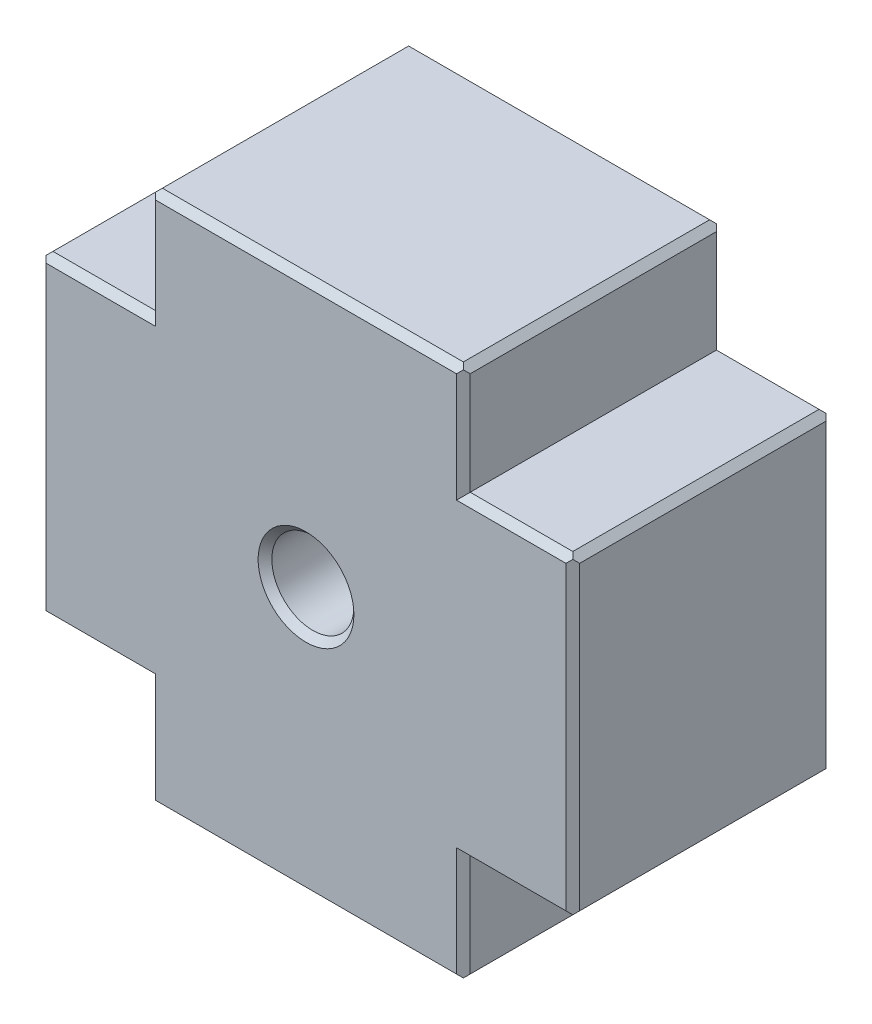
ISO-10303-21;
HEADER;
FILE_DESCRIPTION(('STEP AP214'),'2;1');
FILE_NAME('part.step','',(''),(''),'','','');
FILE_SCHEMA(('AUTOMOTIVE_DESIGN { 1 0 10303 214 1 1 1 1 }'));
ENDSEC;
DATA;
#1=APPLICATION_CONTEXT('core data for automotive mechanical design processes');
#2=APPLICATION_PROTOCOL_DEFINITION('international standard','automotive_design',2000,#1);
#3=PRODUCT_CONTEXT('',#1,'mechanical');
#4=PRODUCT('Part','Part','',(#3));
#5=PRODUCT_RELATED_PRODUCT_CATEGORY('part','',(#4));
#6=PRODUCT_DEFINITION_FORMATION('','',#4);
#7=PRODUCT_DEFINITION_CONTEXT('part definition',#1,'design');
#8=PRODUCT_DEFINITION('design','',#6,#7);
#9=PRODUCT_DEFINITION_SHAPE('','',#8);
#10=(LENGTH_UNIT() NAMED_UNIT(*) SI_UNIT(.MILLI.,.METRE.));
#11=(NAMED_UNIT(*) PLANE_ANGLE_UNIT() SI_UNIT($,.RADIAN.));
#12=(NAMED_UNIT(*) SI_UNIT($,.STERADIAN.) SOLID_ANGLE_UNIT());
#13=UNCERTAINTY_MEASURE_WITH_UNIT(LENGTH_MEASURE(1.E-05),#10,'distance_accuracy_value','');
#14=(GEOMETRIC_REPRESENTATION_CONTEXT(3) GLOBAL_UNCERTAINTY_ASSIGNED_CONTEXT((#13)) GLOBAL_UNIT_ASSIGNED_CONTEXT((#10,
#11,#12)) REPRESENTATION_CONTEXT('',''));
#15=CARTESIAN_POINT('',(0.,0.,0.));
#16=DIRECTION('',(0.,0.,1.));
#17=DIRECTION('',(1.,0.,0.));
#18=AXIS2_PLACEMENT_3D('',#15,#16,#17);
#19=CARTESIAN_POINT('',(0.,-11.5,19.));
#20=DIRECTION('',(0.,-1.,0.));
#21=DIRECTION('',(1.,0.,0.));
#22=AXIS2_PLACEMENT_3D('',#19,#20,#21);
#23=PLANE('',#22);
#24=DIRECTION('',(-1.,0.,0.));
#25=VECTOR('',#24,1.);
#26=CARTESIAN_POINT('',(0.,-11.5,18.5));
#27=LINE('',#26,#25);
#28=CARTESIAN_POINT('',(-11.5,-11.5,18.5));
#29=VERTEX_POINT('',#28);
#30=CARTESIAN_POINT('',(-19.,-11.5,18.5));
#31=VERTEX_POINT('',#30);
#32=EDGE_CURVE('E314',#29,#31,#27,.T.);
#33=ORIENTED_EDGE('',*,*,#32,.T.);
#34=DIRECTION('',(0.,0.,-1.));
#35=VECTOR('',#34,1.);
#36=CARTESIAN_POINT('',(-19.,-11.5,19.));
#37=LINE('',#36,#35);
#38=CARTESIAN_POINT('',(-19.,-11.5,0.5));
#39=VERTEX_POINT('',#38);
#40=EDGE_CURVE('E446',#31,#39,#37,.T.);
#41=ORIENTED_EDGE('',*,*,#40,.T.);
#42=DIRECTION('',(1.,0.,0.));
#43=VECTOR('',#42,1.);
#44=CARTESIAN_POINT('',(-11.5,-11.5,0.500000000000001));
#45=LINE('',#44,#43);
#46=CARTESIAN_POINT('',(-11.5,-11.5,0.5));
#47=VERTEX_POINT('',#46);
#48=EDGE_CURVE('E317',#39,#47,#45,.T.);
#49=ORIENTED_EDGE('',*,*,#48,.T.);
#50=DIRECTION('',(0.,0.,-1.));
#51=VECTOR('',#50,1.);
#52=CARTESIAN_POINT('',(-11.5,-11.5,19.));
#53=LINE('',#52,#51);
#54=EDGE_CURVE('E301',#29,#47,#53,.T.);
#55=ORIENTED_EDGE('',*,*,#54,.F.);
#56=EDGE_LOOP('',(#33,#41,#49,#55));
#57=FACE_BOUND('',#56,.T.);
#58=ADVANCED_FACE('F37',(#57),#23,.T.);
#59=CARTESIAN_POINT('',(-11.5,0.,19.));
#60=DIRECTION('',(1.,0.,0.));
#61=DIRECTION('',(0.,1.,0.));
#62=AXIS2_PLACEMENT_3D('',#59,#60,#61);
#63=PLANE('',#62);
#64=DIRECTION('',(0.,-1.,0.));
#65=VECTOR('',#64,1.);
#66=CARTESIAN_POINT('',(-11.5,0.,0.5));
#67=LINE('',#66,#65);
#68=CARTESIAN_POINT('',(-11.5,-19.,0.5));
#69=VERTEX_POINT('',#68);
#70=EDGE_CURVE('E308',#47,#69,#67,.T.);
#71=ORIENTED_EDGE('',*,*,#70,.T.);
#72=DIRECTION('',(0.,0.,1.));
#73=VECTOR('',#72,1.);
#74=CARTESIAN_POINT('',(-11.5,-19.,18.5));
#75=LINE('',#74,#73);
#76=CARTESIAN_POINT('',(-11.5,-19.,18.5));
#77=VERTEX_POINT('',#76);
#78=EDGE_CURVE('E304',#69,#77,#75,.T.);
#79=ORIENTED_EDGE('',*,*,#78,.T.);
#80=DIRECTION('',(0.,1.,0.));
#81=VECTOR('',#80,1.);
#82=CARTESIAN_POINT('',(-11.5,-11.5,18.5));
#83=LINE('',#82,#81);
#84=EDGE_CURVE('E297',#77,#29,#83,.T.);
#85=ORIENTED_EDGE('',*,*,#84,.T.);
#86=ORIENTED_EDGE('',*,*,#54,.T.);
#87=EDGE_LOOP('',(#71,#79,#85,#86));
#88=FACE_BOUND('',#87,.T.);
#89=ADVANCED_FACE('F300',(#88),#63,.F.);
#90=CARTESIAN_POINT('',(0.,-19.5,19.));
#91=DIRECTION('',(0.,-1.,0.));
#92=DIRECTION('',(1.,0.,0.));
#93=AXIS2_PLACEMENT_3D('',#90,#91,#92);
#94=PLANE('',#93);
#95=DIRECTION('',(-1.,0.,0.));
#96=VECTOR('',#95,1.);
#97=CARTESIAN_POINT('',(0.,-19.5,18.5));
#98=LINE('',#97,#96);
#99=CARTESIAN_POINT('',(11.,-19.5,18.5));
#100=VERTEX_POINT('',#99);
#101=CARTESIAN_POINT('',(-11.,-19.5,18.5));
#102=VERTEX_POINT('',#101);
#103=EDGE_CURVE('E615',#100,#102,#98,.T.);
#104=ORIENTED_EDGE('',*,*,#103,.T.);
#105=DIRECTION('',(0.,0.,-1.));
#106=VECTOR('',#105,1.);
#107=CARTESIAN_POINT('',(-11.,-19.5,0.5));
#108=LINE('',#107,#106);
#109=CARTESIAN_POINT('',(-11.,-19.5,0.499999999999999));
#110=VERTEX_POINT('',#109);
#111=EDGE_CURVE('E453',#102,#110,#108,.T.);
#112=ORIENTED_EDGE('',*,*,#111,.T.);
#113=DIRECTION('',(1.,0.,0.));
#114=VECTOR('',#113,1.);
#115=CARTESIAN_POINT('',(11.5,-19.5,0.5));
#116=LINE('',#115,#114);
#117=CARTESIAN_POINT('',(11.,-19.5,0.5));
#118=VERTEX_POINT('',#117);
#119=EDGE_CURVE('E612',#110,#118,#116,.T.);
#120=ORIENTED_EDGE('',*,*,#119,.T.);
#121=DIRECTION('',(0.,0.,1.));
#122=VECTOR('',#121,1.);
#123=CARTESIAN_POINT('',(11.,-19.5,19.));
#124=LINE('',#123,#122);
#125=EDGE_CURVE('E451',#118,#100,#124,.T.);
#126=ORIENTED_EDGE('',*,*,#125,.T.);
#127=EDGE_LOOP('',(#104,#112,#120,#126));
#128=FACE_BOUND('',#127,.T.);
#129=ADVANCED_FACE('F775',(#128),#94,.T.);
#130=CARTESIAN_POINT('',(11.5,0.,19.));
#131=DIRECTION('',(1.,0.,0.));
#132=DIRECTION('',(0.,1.,0.));
#133=AXIS2_PLACEMENT_3D('',#130,#131,#132);
#134=PLANE('',#133);
#135=DIRECTION('',(0.,-1.,0.));
#136=VECTOR('',#135,1.);
#137=CARTESIAN_POINT('',(11.5,0.,18.5));
#138=LINE('',#137,#136);
#139=CARTESIAN_POINT('',(11.5,-11.5,18.5));
#140=VERTEX_POINT('',#139);
#141=CARTESIAN_POINT('',(11.5,-19.,18.5));
#142=VERTEX_POINT('',#141);
#143=EDGE_CURVE('E609',#140,#142,#138,.T.);
#144=ORIENTED_EDGE('',*,*,#143,.T.);
#145=DIRECTION('',(0.,0.,-1.));
#146=VECTOR('',#145,1.);
#147=CARTESIAN_POINT('',(11.5,-19.,19.));
#148=LINE('',#147,#146);
#149=CARTESIAN_POINT('',(11.5,-19.,0.5));
#150=VERTEX_POINT('',#149);
#151=EDGE_CURVE('E469',#142,#150,#148,.T.);
#152=ORIENTED_EDGE('',*,*,#151,.T.);
#153=DIRECTION('',(0.,1.,0.));
#154=VECTOR('',#153,1.);
#155=CARTESIAN_POINT('',(11.5,-11.5,0.5));
#156=LINE('',#155,#154);
#157=CARTESIAN_POINT('',(11.5,-11.5,0.5));
#158=VERTEX_POINT('',#157);
#159=EDGE_CURVE('E607',#150,#158,#156,.T.);
#160=ORIENTED_EDGE('',*,*,#159,.T.);
#161=DIRECTION('',(0.,0.,-1.));
#162=VECTOR('',#161,1.);
#163=CARTESIAN_POINT('',(11.5,-11.5,19.));
#164=LINE('',#163,#162);
#165=EDGE_CURVE('E318',#140,#158,#164,.T.);
#166=ORIENTED_EDGE('',*,*,#165,.F.);
#167=EDGE_LOOP('',(#144,#152,#160,#166));
#168=FACE_BOUND('',#167,.T.);
#169=ADVANCED_FACE('F695',(#168),#134,.T.);
#170=CARTESIAN_POINT('',(0.,-11.5,19.));
#171=DIRECTION('',(0.,1.,0.));
#172=DIRECTION('',(-1.,0.,0.));
#173=AXIS2_PLACEMENT_3D('',#170,#171,#172);
#174=PLANE('',#173);
#175=DIRECTION('',(1.,0.,0.));
#176=VECTOR('',#175,1.);
#177=CARTESIAN_POINT('',(0.,-11.5,0.5));
#178=LINE('',#177,#176);
#179=CARTESIAN_POINT('',(19.,-11.5,0.5));
#180=VERTEX_POINT('',#179);
#181=EDGE_CURVE('E602',#158,#180,#178,.T.);
#182=ORIENTED_EDGE('',*,*,#181,.T.);
#183=DIRECTION('',(0.,0.,1.));
#184=VECTOR('',#183,1.);
#185=CARTESIAN_POINT('',(19.,-11.5,19.));
#186=LINE('',#185,#184);
#187=CARTESIAN_POINT('',(19.,-11.5,18.5));
#188=VERTEX_POINT('',#187);
#189=EDGE_CURVE('E487',#180,#188,#186,.T.);
#190=ORIENTED_EDGE('',*,*,#189,.T.);
#191=DIRECTION('',(-1.,0.,0.));
#192=VECTOR('',#191,1.);
#193=CARTESIAN_POINT('',(11.5,-11.5,18.5));
#194=LINE('',#193,#192);
#195=EDGE_CURVE('E605',#188,#140,#194,.T.);
#196=ORIENTED_EDGE('',*,*,#195,.T.);
#197=ORIENTED_EDGE('',*,*,#165,.T.);
#198=EDGE_LOOP('',(#182,#190,#196,#197));
#199=FACE_BOUND('',#198,.T.);
#200=ADVANCED_FACE('F709',(#199),#174,.F.);
#201=CARTESIAN_POINT('',(19.5,0.,19.));
#202=DIRECTION('',(-1.,0.,0.));
#203=DIRECTION('',(0.,0.,1.));
#204=AXIS2_PLACEMENT_3D('',#201,#202,#203);
#205=PLANE('',#204);
#206=DIRECTION('',(0.,-1.,0.));
#207=VECTOR('',#206,1.);
#208=CARTESIAN_POINT('',(19.5,-11.5,18.5));
#209=LINE('',#208,#207);
#210=CARTESIAN_POINT('',(19.5,11.,18.5));
#211=VERTEX_POINT('',#210);
#212=CARTESIAN_POINT('',(19.5,-11.,18.5));
#213=VERTEX_POINT('',#212);
#214=EDGE_CURVE('E599',#211,#213,#209,.T.);
#215=ORIENTED_EDGE('',*,*,#214,.T.);
#216=DIRECTION('',(0.,0.,-1.));
#217=VECTOR('',#216,1.);
#218=CARTESIAN_POINT('',(19.5,-11.,19.));
#219=LINE('',#218,#217);
#220=CARTESIAN_POINT('',(19.5,-11.,0.5));
#221=VERTEX_POINT('',#220);
#222=EDGE_CURVE('E478',#213,#221,#219,.T.);
#223=ORIENTED_EDGE('',*,*,#222,.T.);
#224=DIRECTION('',(0.,1.,0.));
#225=VECTOR('',#224,1.);
#226=CARTESIAN_POINT('',(19.5,0.,0.5));
#227=LINE('',#226,#225);
#228=CARTESIAN_POINT('',(19.5,11.,0.5));
#229=VERTEX_POINT('',#228);
#230=EDGE_CURVE('E596',#221,#229,#227,.T.);
#231=ORIENTED_EDGE('',*,*,#230,.T.);
#232=DIRECTION('',(0.,0.,1.));
#233=VECTOR('',#232,1.);
#234=CARTESIAN_POINT('',(19.5,11.,18.5));
#235=LINE('',#234,#233);
#236=EDGE_CURVE('E476',#229,#211,#235,.T.);
#237=ORIENTED_EDGE('',*,*,#236,.T.);
#238=EDGE_LOOP('',(#215,#223,#231,#237));
#239=FACE_BOUND('',#238,.T.);
#240=ADVANCED_FACE('F789',(#239),#205,.F.);
#241=CARTESIAN_POINT('',(0.,11.5,19.));
#242=DIRECTION('',(0.,1.,0.));
#243=DIRECTION('',(-1.,0.,0.));
#244=AXIS2_PLACEMENT_3D('',#241,#242,#243);
#245=PLANE('',#244);
#246=DIRECTION('',(1.,0.,0.));
#247=VECTOR('',#246,1.);
#248=CARTESIAN_POINT('',(0.,11.5,18.5));
#249=LINE('',#248,#247);
#250=CARTESIAN_POINT('',(11.5,11.5,18.5));
#251=VERTEX_POINT('',#250);
#252=CARTESIAN_POINT('',(19.,11.5,18.5));
#253=VERTEX_POINT('',#252);
#254=EDGE_CURVE('E593',#251,#253,#249,.T.);
#255=ORIENTED_EDGE('',*,*,#254,.T.);
#256=DIRECTION('',(0.,0.,-1.));
#257=VECTOR('',#256,1.);
#258=CARTESIAN_POINT('',(19.,11.5,0.5));
#259=LINE('',#258,#257);
#260=CARTESIAN_POINT('',(19.,11.5,0.500000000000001));
#261=VERTEX_POINT('',#260);
#262=EDGE_CURVE('E495',#253,#261,#259,.T.);
#263=ORIENTED_EDGE('',*,*,#262,.T.);
#264=DIRECTION('',(-1.,0.,0.));
#265=VECTOR('',#264,1.);
#266=CARTESIAN_POINT('',(11.5,11.5,0.500000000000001));
#267=LINE('',#266,#265);
#268=CARTESIAN_POINT('',(11.5,11.5,0.5));
#269=VERTEX_POINT('',#268);
#270=EDGE_CURVE('E591',#261,#269,#267,.T.);
#271=ORIENTED_EDGE('',*,*,#270,.T.);
#272=DIRECTION('',(0.,0.,-1.));
#273=VECTOR('',#272,1.);
#274=CARTESIAN_POINT('',(11.5,11.5,19.));
#275=LINE('',#274,#273);
#276=EDGE_CURVE('E650',#251,#269,#275,.T.);
#277=ORIENTED_EDGE('',*,*,#276,.F.);
#278=EDGE_LOOP('',(#255,#263,#271,#277));
#279=FACE_BOUND('',#278,.T.);
#280=ADVANCED_FACE('F799',(#279),#245,.T.);
#281=CARTESIAN_POINT('',(11.5,0.,19.));
#282=DIRECTION('',(-1.,0.,0.));
#283=DIRECTION('',(0.,-1.,0.));
#284=AXIS2_PLACEMENT_3D('',#281,#282,#283);
#285=PLANE('',#284);
#286=DIRECTION('',(0.,1.,0.));
#287=VECTOR('',#286,1.);
#288=CARTESIAN_POINT('',(11.5,0.,0.5));
#289=LINE('',#288,#287);
#290=CARTESIAN_POINT('',(11.5,19.,0.5));
#291=VERTEX_POINT('',#290);
#292=EDGE_CURVE('E586',#269,#291,#289,.T.);
#293=ORIENTED_EDGE('',*,*,#292,.T.);
#294=DIRECTION('',(0.,0.,1.));
#295=VECTOR('',#294,1.);
#296=CARTESIAN_POINT('',(11.5,19.,19.));
#297=LINE('',#296,#295);
#298=CARTESIAN_POINT('',(11.5,19.,18.5));
#299=VERTEX_POINT('',#298);
#300=EDGE_CURVE('E513',#291,#299,#297,.T.);
#301=ORIENTED_EDGE('',*,*,#300,.T.);
#302=DIRECTION('',(0.,-1.,0.));
#303=VECTOR('',#302,1.);
#304=CARTESIAN_POINT('',(11.5,11.5,18.5));
#305=LINE('',#304,#303);
#306=EDGE_CURVE('E589',#299,#251,#305,.T.);
#307=ORIENTED_EDGE('',*,*,#306,.T.);
#308=ORIENTED_EDGE('',*,*,#276,.T.);
#309=EDGE_LOOP('',(#293,#301,#307,#308));
#310=FACE_BOUND('',#309,.T.);
#311=ADVANCED_FACE('F803',(#310),#285,.F.);
#312=CARTESIAN_POINT('',(0.,19.5,19.));
#313=DIRECTION('',(0.,-1.,0.));
#314=DIRECTION('',(1.,0.,0.));
#315=AXIS2_PLACEMENT_3D('',#312,#313,#314);
#316=PLANE('',#315);
#317=DIRECTION('',(1.,0.,0.));
#318=VECTOR('',#317,1.);
#319=CARTESIAN_POINT('',(11.5,19.5,18.5));
#320=LINE('',#319,#318);
#321=CARTESIAN_POINT('',(-11.,19.5,18.5));
#322=VERTEX_POINT('',#321);
#323=CARTESIAN_POINT('',(11.,19.5,18.5));
#324=VERTEX_POINT('',#323);
#325=EDGE_CURVE('E583',#322,#324,#320,.T.);
#326=ORIENTED_EDGE('',*,*,#325,.T.);
#327=DIRECTION('',(0.,0.,-1.));
#328=VECTOR('',#327,1.);
#329=CARTESIAN_POINT('',(11.,19.5,19.));
#330=LINE('',#329,#328);
#331=CARTESIAN_POINT('',(11.,19.5,0.5));
#332=VERTEX_POINT('',#331);
#333=EDGE_CURVE('E504',#324,#332,#330,.T.);
#334=ORIENTED_EDGE('',*,*,#333,.T.);
#335=DIRECTION('',(-1.,0.,0.));
#336=VECTOR('',#335,1.);
#337=CARTESIAN_POINT('',(0.,19.5,0.5));
#338=LINE('',#337,#336);
#339=CARTESIAN_POINT('',(-11.,19.5,0.5));
#340=VERTEX_POINT('',#339);
#341=EDGE_CURVE('E580',#332,#340,#338,.T.);
#342=ORIENTED_EDGE('',*,*,#341,.T.);
#343=DIRECTION('',(0.,0.,1.));
#344=VECTOR('',#343,1.);
#345=CARTESIAN_POINT('',(-11.,19.5,18.5));
#346=LINE('',#345,#344);
#347=EDGE_CURVE('E502',#340,#322,#346,.T.);
#348=ORIENTED_EDGE('',*,*,#347,.T.);
#349=EDGE_LOOP('',(#326,#334,#342,#348));
#350=FACE_BOUND('',#349,.T.);
#351=ADVANCED_FACE('F749',(#350),#316,.F.);
#352=CARTESIAN_POINT('',(-11.5,0.,19.));
#353=DIRECTION('',(-1.,0.,0.));
#354=DIRECTION('',(0.,-1.,0.));
#355=AXIS2_PLACEMENT_3D('',#352,#353,#354);
#356=PLANE('',#355);
#357=DIRECTION('',(0.,1.,0.));
#358=VECTOR('',#357,1.);
#359=CARTESIAN_POINT('',(-11.5,0.,18.5));
#360=LINE('',#359,#358);
#361=CARTESIAN_POINT('',(-11.5,11.5,18.5));
#362=VERTEX_POINT('',#361);
#363=CARTESIAN_POINT('',(-11.5,19.,18.5));
#364=VERTEX_POINT('',#363);
#365=EDGE_CURVE('E578',#362,#364,#360,.T.);
#366=ORIENTED_EDGE('',*,*,#365,.T.);
#367=DIRECTION('',(0.,0.,-1.));
#368=VECTOR('',#367,1.);
#369=CARTESIAN_POINT('',(-11.5,19.,0.5));
#370=LINE('',#369,#368);
#371=CARTESIAN_POINT('',(-11.5,19.,0.5));
#372=VERTEX_POINT('',#371);
#373=EDGE_CURVE('E521',#364,#372,#370,.T.);
#374=ORIENTED_EDGE('',*,*,#373,.T.);
#375=DIRECTION('',(0.,-1.,0.));
#376=VECTOR('',#375,1.);
#377=CARTESIAN_POINT('',(-11.5,11.5,0.5));
#378=LINE('',#377,#376);
#379=CARTESIAN_POINT('',(-11.5,11.5,0.5));
#380=VERTEX_POINT('',#379);
#381=EDGE_CURVE('E576',#372,#380,#378,.T.);
#382=ORIENTED_EDGE('',*,*,#381,.T.);
#383=DIRECTION('',(0.,0.,-1.));
#384=VECTOR('',#383,1.);
#385=CARTESIAN_POINT('',(-11.5,11.5,19.));
#386=LINE('',#385,#384);
#387=EDGE_CURVE('E402',#362,#380,#386,.T.);
#388=ORIENTED_EDGE('',*,*,#387,.F.);
#389=EDGE_LOOP('',(#366,#374,#382,#388));
#390=FACE_BOUND('',#389,.T.);
#391=ADVANCED_FACE('F745',(#390),#356,.T.);
#392=CARTESIAN_POINT('',(0.,11.5,19.));
#393=DIRECTION('',(0.,-1.,0.));
#394=DIRECTION('',(1.,0.,0.));
#395=AXIS2_PLACEMENT_3D('',#392,#393,#394);
#396=PLANE('',#395);
#397=DIRECTION('',(-1.,0.,0.));
#398=VECTOR('',#397,1.);
#399=CARTESIAN_POINT('',(0.,11.5,0.5));
#400=LINE('',#399,#398);
#401=CARTESIAN_POINT('',(-19.,11.5,0.5));
#402=VERTEX_POINT('',#401);
#403=EDGE_CURVE('E571',#380,#402,#400,.T.);
#404=ORIENTED_EDGE('',*,*,#403,.T.);
#405=DIRECTION('',(0.,0.,1.));
#406=VECTOR('',#405,1.);
#407=CARTESIAN_POINT('',(-19.,11.5,18.5));
#408=LINE('',#407,#406);
#409=CARTESIAN_POINT('',(-19.,11.5,18.5));
#410=VERTEX_POINT('',#409);
#411=EDGE_CURVE('E438',#402,#410,#408,.T.);
#412=ORIENTED_EDGE('',*,*,#411,.T.);
#413=DIRECTION('',(1.,0.,0.));
#414=VECTOR('',#413,1.);
#415=CARTESIAN_POINT('',(-11.5,11.5,18.5));
#416=LINE('',#415,#414);
#417=EDGE_CURVE('E559',#410,#362,#416,.T.);
#418=ORIENTED_EDGE('',*,*,#417,.T.);
#419=ORIENTED_EDGE('',*,*,#387,.T.);
#420=EDGE_LOOP('',(#404,#412,#418,#419));
#421=FACE_BOUND('',#420,.T.);
#422=ADVANCED_FACE('F657',(#421),#396,.F.);
#423=CARTESIAN_POINT('',(-19.5,0.,19.));
#424=DIRECTION('',(-1.,0.,0.));
#425=DIRECTION('',(0.,0.,1.));
#426=AXIS2_PLACEMENT_3D('',#423,#424,#425);
#427=PLANE('',#426);
#428=DIRECTION('',(0.,1.,0.));
#429=VECTOR('',#428,1.);
#430=CARTESIAN_POINT('',(-19.5,0.,18.5));
#431=LINE('',#430,#429);
#432=CARTESIAN_POINT('',(-19.5,-11.,18.5));
#433=VERTEX_POINT('',#432);
#434=CARTESIAN_POINT('',(-19.5,11.,18.5));
#435=VERTEX_POINT('',#434);
#436=EDGE_CURVE('E340',#433,#435,#431,.T.);
#437=ORIENTED_EDGE('',*,*,#436,.T.);
#438=DIRECTION('',(0.,0.,-1.));
#439=VECTOR('',#438,1.);
#440=CARTESIAN_POINT('',(-19.5,11.,0.5));
#441=LINE('',#440,#439);
#442=CARTESIAN_POINT('',(-19.5,11.,0.5));
#443=VERTEX_POINT('',#442);
#444=EDGE_CURVE('E429',#435,#443,#441,.T.);
#445=ORIENTED_EDGE('',*,*,#444,.T.);
#446=DIRECTION('',(0.,-1.,0.));
#447=VECTOR('',#446,1.);
#448=CARTESIAN_POINT('',(-19.5,-11.5,0.5));
#449=LINE('',#448,#447);
#450=CARTESIAN_POINT('',(-19.5,-11.,0.5));
#451=VERTEX_POINT('',#450);
#452=EDGE_CURVE('E335',#443,#451,#449,.T.);
#453=ORIENTED_EDGE('',*,*,#452,.T.);
#454=DIRECTION('',(0.,0.,1.));
#455=VECTOR('',#454,1.);
#456=CARTESIAN_POINT('',(-19.5,-11.,19.));
#457=LINE('',#456,#455);
#458=EDGE_CURVE('E369',#451,#433,#457,.T.);
#459=ORIENTED_EDGE('',*,*,#458,.T.);
#460=EDGE_LOOP('',(#437,#445,#453,#459));
#461=FACE_BOUND('',#460,.T.);
#462=ADVANCED_FACE('F545',(#461),#427,.T.);
#463=CARTESIAN_POINT('',(0.,0.,19.));
#464=DIRECTION('',(0.,0.,1.));
#465=DIRECTION('',(1.,0.,0.));
#466=AXIS2_PLACEMENT_3D('',#463,#464,#465);
#467=PLANE('',#466);
#468=CARTESIAN_POINT('',(0.,0.,19.));
#469=DIRECTION('',(0.,0.,1.));
#470=DIRECTION('',(1.,0.,0.));
#471=AXIS2_PLACEMENT_3D('',#468,#469,#470);
#472=CIRCLE('',#471,3.5);
#473=CARTESIAN_POINT('',(3.5,0.,19.));
#474=VERTEX_POINT('',#473);
#475=EDGE_CURVE('E525',#474,#474,#472,.F.);
#476=ORIENTED_EDGE('',*,*,#475,.T.);
#477=EDGE_LOOP('',(#476));
#478=FACE_BOUND('',#477,.T.);
#479=DIRECTION('',(-1.,0.,0.));
#480=VECTOR('',#479,1.);
#481=CARTESIAN_POINT('',(-19.5,11.,19.));
#482=LINE('',#481,#480);
#483=CARTESIAN_POINT('',(-11.,11.,19.));
#484=VERTEX_POINT('',#483);
#485=CARTESIAN_POINT('',(-19.,11.,19.));
#486=VERTEX_POINT('',#485);
#487=EDGE_CURVE('E364',#484,#486,#482,.T.);
#488=ORIENTED_EDGE('',*,*,#487,.T.);
#489=DIRECTION('',(0.,-1.,0.));
#490=VECTOR('',#489,1.);
#491=CARTESIAN_POINT('',(-19.,0.,19.));
#492=LINE('',#491,#490);
#493=CARTESIAN_POINT('',(-19.,-11.,19.));
#494=VERTEX_POINT('',#493);
#495=EDGE_CURVE('E366',#486,#494,#492,.T.);
#496=ORIENTED_EDGE('',*,*,#495,.T.);
#497=DIRECTION('',(1.,0.,0.));
#498=VECTOR('',#497,1.);
#499=CARTESIAN_POINT('',(0.,-11.,19.));
#500=LINE('',#499,#498);
#501=CARTESIAN_POINT('',(-11.,-11.,19.));
#502=VERTEX_POINT('',#501);
#503=EDGE_CURVE('E337',#494,#502,#500,.T.);
#504=ORIENTED_EDGE('',*,*,#503,.T.);
#505=DIRECTION('',(0.,-1.,0.));
#506=VECTOR('',#505,1.);
#507=CARTESIAN_POINT('',(-11.,-19.5,19.));
#508=LINE('',#507,#506);
#509=CARTESIAN_POINT('',(-11.,-19.,19.));
#510=VERTEX_POINT('',#509);
#511=EDGE_CURVE('E325',#502,#510,#508,.T.);
#512=ORIENTED_EDGE('',*,*,#511,.T.);
#513=DIRECTION('',(1.,0.,0.));
#514=VECTOR('',#513,1.);
#515=CARTESIAN_POINT('',(0.,-19.,19.));
#516=LINE('',#515,#514);
#517=CARTESIAN_POINT('',(11.,-19.,19.));
#518=VERTEX_POINT('',#517);
#519=EDGE_CURVE('E346',#510,#518,#516,.T.);
#520=ORIENTED_EDGE('',*,*,#519,.T.);
#521=DIRECTION('',(0.,1.,0.));
#522=VECTOR('',#521,1.);
#523=CARTESIAN_POINT('',(11.,0.,19.));
#524=LINE('',#523,#522);
#525=CARTESIAN_POINT('',(11.,-11.,19.));
#526=VERTEX_POINT('',#525);
#527=EDGE_CURVE('E349',#518,#526,#524,.T.);
#528=ORIENTED_EDGE('',*,*,#527,.T.);
#529=DIRECTION('',(1.,0.,0.));
#530=VECTOR('',#529,1.);
#531=CARTESIAN_POINT('',(19.5,-11.,19.));
#532=LINE('',#531,#530);
#533=CARTESIAN_POINT('',(19.,-11.,19.));
#534=VERTEX_POINT('',#533);
#535=EDGE_CURVE('E351',#526,#534,#532,.T.);
#536=ORIENTED_EDGE('',*,*,#535,.T.);
#537=DIRECTION('',(0.,1.,0.));
#538=VECTOR('',#537,1.);
#539=CARTESIAN_POINT('',(19.,11.5,19.));
#540=LINE('',#539,#538);
#541=CARTESIAN_POINT('',(19.,11.,19.));
#542=VERTEX_POINT('',#541);
#543=EDGE_CURVE('E354',#534,#542,#540,.T.);
#544=ORIENTED_EDGE('',*,*,#543,.T.);
#545=DIRECTION('',(-1.,0.,0.));
#546=VECTOR('',#545,1.);
#547=CARTESIAN_POINT('',(0.,11.,19.));
#548=LINE('',#547,#546);
#549=CARTESIAN_POINT('',(11.,11.,19.));
#550=VERTEX_POINT('',#549);
#551=EDGE_CURVE('E356',#542,#550,#548,.T.);
#552=ORIENTED_EDGE('',*,*,#551,.T.);
#553=DIRECTION('',(0.,1.,0.));
#554=VECTOR('',#553,1.);
#555=CARTESIAN_POINT('',(11.,19.5,19.));
#556=LINE('',#555,#554);
#557=CARTESIAN_POINT('',(11.,19.,19.));
#558=VERTEX_POINT('',#557);
#559=EDGE_CURVE('E358',#550,#558,#556,.T.);
#560=ORIENTED_EDGE('',*,*,#559,.T.);
#561=DIRECTION('',(-1.,0.,0.));
#562=VECTOR('',#561,1.);
#563=CARTESIAN_POINT('',(-11.5,19.,19.));
#564=LINE('',#563,#562);
#565=CARTESIAN_POINT('',(-11.,19.,19.));
#566=VERTEX_POINT('',#565);
#567=EDGE_CURVE('E360',#558,#566,#564,.T.);
#568=ORIENTED_EDGE('',*,*,#567,.T.);
#569=DIRECTION('',(0.,-1.,0.));
#570=VECTOR('',#569,1.);
#571=CARTESIAN_POINT('',(-11.,0.,19.));
#572=LINE('',#571,#570);
#573=EDGE_CURVE('E362',#566,#484,#572,.T.);
#574=ORIENTED_EDGE('',*,*,#573,.T.);
#575=EDGE_LOOP('',(#488,#496,#504,#512,#520,#528,#536,#544,#552,#560,#568,#574));
#576=FACE_BOUND('',#575,.T.);
#577=ADVANCED_FACE('F541',(#478,#576),#467,.T.);
#578=CARTESIAN_POINT('',(0.,0.,0.));
#579=DIRECTION('',(0.,0.,1.));
#580=DIRECTION('',(1.,0.,0.));
#581=AXIS2_PLACEMENT_3D('',#578,#579,#580);
#582=PLANE('',#581);
#583=CARTESIAN_POINT('',(0.,0.,0.));
#584=DIRECTION('',(0.,0.,1.));
#585=DIRECTION('',(1.,0.,0.));
#586=AXIS2_PLACEMENT_3D('',#583,#584,#585);
#587=CIRCLE('',#586,3.50000000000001);
#588=CARTESIAN_POINT('',(3.50000000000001,0.,0.));
#589=VERTEX_POINT('',#588);
#590=EDGE_CURVE('E11',#589,#589,#587,.T.);
#591=ORIENTED_EDGE('',*,*,#590,.T.);
#592=EDGE_LOOP('',(#591));
#593=FACE_BOUND('',#592,.T.);
#594=DIRECTION('',(-1.,0.,0.));
#595=VECTOR('',#594,1.);
#596=CARTESIAN_POINT('',(-11.5,-19.,0.));
#597=LINE('',#596,#595);
#598=CARTESIAN_POINT('',(11.,-19.,0.));
#599=VERTEX_POINT('',#598);
#600=CARTESIAN_POINT('',(-11.,-19.,0.));
#601=VERTEX_POINT('',#600);
#602=EDGE_CURVE('E621',#599,#601,#597,.T.);
#603=ORIENTED_EDGE('',*,*,#602,.T.);
#604=DIRECTION('',(0.,1.,0.));
#605=VECTOR('',#604,1.);
#606=CARTESIAN_POINT('',(-11.,0.,0.));
#607=LINE('',#606,#605);
#608=CARTESIAN_POINT('',(-11.,-11.,0.));
#609=VERTEX_POINT('',#608);
#610=EDGE_CURVE('E618',#601,#609,#607,.T.);
#611=ORIENTED_EDGE('',*,*,#610,.T.);
#612=DIRECTION('',(-1.,0.,0.));
#613=VECTOR('',#612,1.);
#614=CARTESIAN_POINT('',(-19.5,-11.,0.));
#615=LINE('',#614,#613);
#616=CARTESIAN_POINT('',(-19.,-11.,0.));
#617=VERTEX_POINT('',#616);
#618=EDGE_CURVE('E644',#609,#617,#615,.T.);
#619=ORIENTED_EDGE('',*,*,#618,.T.);
#620=DIRECTION('',(0.,1.,0.));
#621=VECTOR('',#620,1.);
#622=CARTESIAN_POINT('',(-19.,11.5,0.));
#623=LINE('',#622,#621);
#624=CARTESIAN_POINT('',(-19.,11.,0.));
#625=VERTEX_POINT('',#624);
#626=EDGE_CURVE('E641',#617,#625,#623,.T.);
#627=ORIENTED_EDGE('',*,*,#626,.T.);
#628=DIRECTION('',(1.,0.,0.));
#629=VECTOR('',#628,1.);
#630=CARTESIAN_POINT('',(0.,11.,0.));
#631=LINE('',#630,#629);
#632=CARTESIAN_POINT('',(-11.,11.,0.));
#633=VERTEX_POINT('',#632);
#634=EDGE_CURVE('E639',#625,#633,#631,.T.);
#635=ORIENTED_EDGE('',*,*,#634,.T.);
#636=DIRECTION('',(0.,1.,0.));
#637=VECTOR('',#636,1.);
#638=CARTESIAN_POINT('',(-11.,19.5,0.));
#639=LINE('',#638,#637);
#640=CARTESIAN_POINT('',(-11.,19.,0.));
#641=VERTEX_POINT('',#640);
#642=EDGE_CURVE('E636',#633,#641,#639,.T.);
#643=ORIENTED_EDGE('',*,*,#642,.T.);
#644=DIRECTION('',(1.,0.,0.));
#645=VECTOR('',#644,1.);
#646=CARTESIAN_POINT('',(0.,19.,0.));
#647=LINE('',#646,#645);
#648=CARTESIAN_POINT('',(11.,19.,0.));
#649=VERTEX_POINT('',#648);
#650=EDGE_CURVE('E633',#641,#649,#647,.T.);
#651=ORIENTED_EDGE('',*,*,#650,.T.);
#652=DIRECTION('',(0.,-1.,0.));
#653=VECTOR('',#652,1.);
#654=CARTESIAN_POINT('',(11.,0.,0.));
#655=LINE('',#654,#653);
#656=CARTESIAN_POINT('',(11.,11.,0.));
#657=VERTEX_POINT('',#656);
#658=EDGE_CURVE('E631',#649,#657,#655,.T.);
#659=ORIENTED_EDGE('',*,*,#658,.T.);
#660=DIRECTION('',(1.,0.,0.));
#661=VECTOR('',#660,1.);
#662=CARTESIAN_POINT('',(19.5,11.,0.));
#663=LINE('',#662,#661);
#664=CARTESIAN_POINT('',(19.,11.,0.));
#665=VERTEX_POINT('',#664);
#666=EDGE_CURVE('E629',#657,#665,#663,.T.);
#667=ORIENTED_EDGE('',*,*,#666,.T.);
#668=DIRECTION('',(0.,-1.,0.));
#669=VECTOR('',#668,1.);
#670=CARTESIAN_POINT('',(19.,0.,0.));
#671=LINE('',#670,#669);
#672=CARTESIAN_POINT('',(19.,-11.,0.));
#673=VERTEX_POINT('',#672);
#674=EDGE_CURVE('E627',#665,#673,#671,.T.);
#675=ORIENTED_EDGE('',*,*,#674,.T.);
#676=DIRECTION('',(-1.,0.,0.));
#677=VECTOR('',#676,1.);
#678=CARTESIAN_POINT('',(0.,-11.,0.));
#679=LINE('',#678,#677);
#680=CARTESIAN_POINT('',(11.,-11.,0.));
#681=VERTEX_POINT('',#680);
#682=EDGE_CURVE('E625',#673,#681,#679,.T.);
#683=ORIENTED_EDGE('',*,*,#682,.T.);
#684=DIRECTION('',(0.,-1.,0.));
#685=VECTOR('',#684,1.);
#686=CARTESIAN_POINT('',(11.,-19.5,0.));
#687=LINE('',#686,#685);
#688=EDGE_CURVE('E623',#681,#599,#687,.T.);
#689=ORIENTED_EDGE('',*,*,#688,.T.);
#690=EDGE_LOOP('',(#603,#611,#619,#627,#635,#643,#651,#659,#667,#675,#683,#689));
#691=FACE_BOUND('',#690,.T.);
#692=ADVANCED_FACE('F544',(#593,#691),#582,.F.);
#693=CARTESIAN_POINT('',(11.5,0.,0.5));
#694=DIRECTION('',(-0.707106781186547,0.,0.707106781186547));
#695=DIRECTION('',(0.,1.,0.));
#696=AXIS2_PLACEMENT_3D('',#693,#694,#695);
#697=PLANE('',#696);
#698=DIRECTION('',(-0.577350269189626,-0.577350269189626,-0.577350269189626));
#699=VECTOR('',#698,1.);
#700=CARTESIAN_POINT('',(7.66666666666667,15.6666666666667,-3.33333333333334));
#701=LINE('',#700,#699);
#702=CARTESIAN_POINT('',(11.25,19.25,0.250000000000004));
#703=VERTEX_POINT('',#702);
#704=EDGE_CURVE('E400',#703,#649,#701,.T.);
#705=ORIENTED_EDGE('',*,*,#704,.F.);
#706=DIRECTION('',(0.577350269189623,-0.577350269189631,0.577350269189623));
#707=VECTOR('',#706,1.);
#708=CARTESIAN_POINT('',(17.8333333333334,12.6666666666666,6.83333333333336));
#709=LINE('',#708,#707);
#710=EDGE_CURVE('E511',#703,#291,#709,.T.);
#711=ORIENTED_EDGE('',*,*,#710,.T.);
#712=ORIENTED_EDGE('',*,*,#292,.F.);
#713=DIRECTION('',(0.577350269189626,0.577350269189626,0.577350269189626));
#714=VECTOR('',#713,1.);
#715=CARTESIAN_POINT('',(7.33333333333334,7.33333333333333,-3.66666666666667));
#716=LINE('',#715,#714);
#717=EDGE_CURVE('E397',#657,#269,#716,.T.);
#718=ORIENTED_EDGE('',*,*,#717,.F.);
#719=ORIENTED_EDGE('',*,*,#658,.F.);
#720=EDGE_LOOP('',(#705,#711,#712,#718,#719));
#721=FACE_BOUND('',#720,.T.);
#722=ADVANCED_FACE('F806',(#721),#697,.F.);
#723=CARTESIAN_POINT('',(0.,19.5,0.5));
#724=DIRECTION('',(0.,-0.707106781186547,0.707106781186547));
#725=DIRECTION('',(-1.,0.,0.));
#726=AXIS2_PLACEMENT_3D('',#723,#724,#725);
#727=PLANE('',#726);
#728=ORIENTED_EDGE('',*,*,#341,.F.);
#729=DIRECTION('',(0.57735026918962,-0.577350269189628,-0.577350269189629));
#730=VECTOR('',#729,1.);
#731=CARTESIAN_POINT('',(7.33333333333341,23.1666666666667,4.16666666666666));
#732=LINE('',#731,#730);
#733=EDGE_CURVE('E509',#332,#703,#732,.T.);
#734=ORIENTED_EDGE('',*,*,#733,.T.);
#735=ORIENTED_EDGE('',*,*,#704,.T.);
#736=ORIENTED_EDGE('',*,*,#650,.F.);
#737=DIRECTION('',(-0.577350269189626,0.577350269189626,0.577350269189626));
#738=VECTOR('',#737,1.);
#739=CARTESIAN_POINT('',(-4.66666666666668,12.6666666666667,-6.33333333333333));
#740=LINE('',#739,#738);
#741=CARTESIAN_POINT('',(-11.25,19.25,0.249999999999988));
#742=VERTEX_POINT('',#741);
#743=EDGE_CURVE('E395',#742,#641,#740,.F.);
#744=ORIENTED_EDGE('',*,*,#743,.F.);
#745=DIRECTION('',(-0.577350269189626,-0.577350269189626,-0.577350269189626));
#746=VECTOR('',#745,1.);
#747=CARTESIAN_POINT('',(-7.33333333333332,23.1666666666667,4.16666666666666));
#748=LINE('',#747,#746);
#749=EDGE_CURVE('E507',#742,#340,#748,.F.);
#750=ORIENTED_EDGE('',*,*,#749,.T.);
#751=EDGE_LOOP('',(#728,#734,#735,#736,#744,#750));
#752=FACE_BOUND('',#751,.T.);
#753=ADVANCED_FACE('F757',(#752),#727,.F.);
#754=CARTESIAN_POINT('',(0.,11.,0.));
#755=DIRECTION('',(0.,0.707106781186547,-0.707106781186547));
#756=DIRECTION('',(-1.,0.,0.));
#757=AXIS2_PLACEMENT_3D('',#754,#755,#756);
#758=PLANE('',#757);
#759=ORIENTED_EDGE('',*,*,#270,.F.);
#760=DIRECTION('',(0.577350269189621,-0.577350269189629,-0.577350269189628));
#761=VECTOR('',#760,1.);
#762=CARTESIAN_POINT('',(13.0000000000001,17.5,6.49999999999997));
#763=LINE('',#762,#761);
#764=CARTESIAN_POINT('',(19.25,11.25,0.249999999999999));
#765=VERTEX_POINT('',#764);
#766=EDGE_CURVE('E498',#261,#765,#763,.T.);
#767=ORIENTED_EDGE('',*,*,#766,.T.);
#768=DIRECTION('',(0.577350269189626,0.577350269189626,0.577350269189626));
#769=VECTOR('',#768,1.);
#770=CARTESIAN_POINT('',(12.6666666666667,4.66666666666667,-6.33333333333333));
#771=LINE('',#770,#769);
#772=EDGE_CURVE('E392',#665,#765,#771,.T.);
#773=ORIENTED_EDGE('',*,*,#772,.F.);
#774=ORIENTED_EDGE('',*,*,#666,.F.);
#775=ORIENTED_EDGE('',*,*,#717,.T.);
#776=EDGE_LOOP('',(#759,#767,#773,#774,#775));
#777=FACE_BOUND('',#776,.T.);
#778=ADVANCED_FACE('F808',(#777),#758,.T.);
#779=CARTESIAN_POINT('',(-11.,0.,0.));
#780=DIRECTION('',(-0.707106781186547,0.,-0.707106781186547));
#781=DIRECTION('',(0.,-1.,0.));
#782=AXIS2_PLACEMENT_3D('',#779,#780,#781);
#783=PLANE('',#782);
#784=ORIENTED_EDGE('',*,*,#381,.F.);
#785=DIRECTION('',(0.577350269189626,0.577350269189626,-0.577350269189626));
#786=VECTOR('',#785,1.);
#787=CARTESIAN_POINT('',(-17.5,13.,6.49999999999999));
#788=LINE('',#787,#786);
#789=EDGE_CURVE('E60',#372,#742,#788,.T.);
#790=ORIENTED_EDGE('',*,*,#789,.T.);
#791=ORIENTED_EDGE('',*,*,#743,.T.);
#792=ORIENTED_EDGE('',*,*,#642,.F.);
#793=DIRECTION('',(-0.577350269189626,0.577350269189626,0.577350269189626));
#794=VECTOR('',#793,1.);
#795=CARTESIAN_POINT('',(-7.33333333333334,7.33333333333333,-3.66666666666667));
#796=LINE('',#795,#794);
#797=EDGE_CURVE('E389',#380,#633,#796,.F.);
#798=ORIENTED_EDGE('',*,*,#797,.F.);
#799=EDGE_LOOP('',(#784,#790,#791,#792,#798));
#800=FACE_BOUND('',#799,.T.);
#801=ADVANCED_FACE('F663',(#800),#783,.T.);
#802=CARTESIAN_POINT('',(19.5,0.,0.5));
#803=DIRECTION('',(-0.707106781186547,0.,0.707106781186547));
#804=DIRECTION('',(0.,1.,0.));
#805=AXIS2_PLACEMENT_3D('',#802,#803,#804);
#806=PLANE('',#805);
#807=ORIENTED_EDGE('',*,*,#230,.F.);
#808=DIRECTION('',(-0.577350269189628,-0.57735026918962,-0.577350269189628));
#809=VECTOR('',#808,1.);
#810=CARTESIAN_POINT('',(23.1666666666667,-7.33333333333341,4.16666666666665));
#811=LINE('',#810,#809);
#812=CARTESIAN_POINT('',(19.25,-11.25,0.250000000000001));
#813=VERTEX_POINT('',#812);
#814=EDGE_CURVE('E483',#221,#813,#811,.T.);
#815=ORIENTED_EDGE('',*,*,#814,.T.);
#816=DIRECTION('',(-0.577350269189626,0.577350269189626,-0.577350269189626));
#817=VECTOR('',#816,1.);
#818=CARTESIAN_POINT('',(15.6666666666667,-7.66666666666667,-3.33333333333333));
#819=LINE('',#818,#817);
#820=EDGE_CURVE('E386',#673,#813,#819,.F.);
#821=ORIENTED_EDGE('',*,*,#820,.F.);
#822=ORIENTED_EDGE('',*,*,#674,.F.);
#823=ORIENTED_EDGE('',*,*,#772,.T.);
#824=DIRECTION('',(-0.577350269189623,0.577350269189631,-0.577350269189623));
#825=VECTOR('',#824,1.);
#826=CARTESIAN_POINT('',(23.1666666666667,7.33333333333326,4.16666666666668));
#827=LINE('',#826,#825);
#828=EDGE_CURVE('E481',#765,#229,#827,.F.);
#829=ORIENTED_EDGE('',*,*,#828,.T.);
#830=EDGE_LOOP('',(#807,#815,#821,#822,#823,#829));
#831=FACE_BOUND('',#830,.T.);
#832=ADVANCED_FACE('F787',(#831),#806,.F.);
#833=CARTESIAN_POINT('',(0.,11.5,0.5));
#834=DIRECTION('',(0.,-0.707106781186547,0.707106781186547));
#835=DIRECTION('',(-1.,0.,0.));
#836=AXIS2_PLACEMENT_3D('',#833,#834,#835);
#837=PLANE('',#836);
#838=DIRECTION('',(-0.577350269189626,0.577350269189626,0.577350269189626));
#839=VECTOR('',#838,1.);
#840=CARTESIAN_POINT('',(-15.3333333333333,7.33333333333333,-3.66666666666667));
#841=LINE('',#840,#839);
#842=CARTESIAN_POINT('',(-19.25,11.25,0.250000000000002));
#843=VERTEX_POINT('',#842);
#844=EDGE_CURVE('E384',#843,#625,#841,.F.);
#845=ORIENTED_EDGE('',*,*,#844,.F.);
#846=DIRECTION('',(-0.577350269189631,-0.577350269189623,-0.577350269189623));
#847=VECTOR('',#846,1.);
#848=CARTESIAN_POINT('',(-12.6666666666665,17.8333333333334,6.83333333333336));
#849=LINE('',#848,#847);
#850=EDGE_CURVE('E436',#843,#402,#849,.F.);
#851=ORIENTED_EDGE('',*,*,#850,.T.);
#852=ORIENTED_EDGE('',*,*,#403,.F.);
#853=ORIENTED_EDGE('',*,*,#797,.T.);
#854=ORIENTED_EDGE('',*,*,#634,.F.);
#855=EDGE_LOOP('',(#845,#851,#852,#853,#854));
#856=FACE_BOUND('',#855,.T.);
#857=ADVANCED_FACE('F667',(#856),#837,.F.);
#858=CARTESIAN_POINT('',(0.,-11.5,0.5));
#859=DIRECTION('',(0.,0.707106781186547,0.707106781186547));
#860=DIRECTION('',(1.,0.,0.));
#861=AXIS2_PLACEMENT_3D('',#858,#859,#860);
#862=PLANE('',#861);
#863=ORIENTED_EDGE('',*,*,#820,.T.);
#864=DIRECTION('',(-0.577350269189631,-0.577350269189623,0.577350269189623));
#865=VECTOR('',#864,1.);
#866=CARTESIAN_POINT('',(12.6666666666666,-17.8333333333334,6.83333333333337));
#867=LINE('',#866,#865);
#868=EDGE_CURVE('E485',#813,#180,#867,.T.);
#869=ORIENTED_EDGE('',*,*,#868,.T.);
#870=ORIENTED_EDGE('',*,*,#181,.F.);
#871=DIRECTION('',(0.577350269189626,-0.577350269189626,0.577350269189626));
#872=VECTOR('',#871,1.);
#873=CARTESIAN_POINT('',(7.33333333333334,-7.33333333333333,-3.66666666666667));
#874=LINE('',#873,#872);
#875=EDGE_CURVE('E381',#681,#158,#874,.T.);
#876=ORIENTED_EDGE('',*,*,#875,.F.);
#877=ORIENTED_EDGE('',*,*,#682,.F.);
#878=EDGE_LOOP('',(#863,#869,#870,#876,#877));
#879=FACE_BOUND('',#878,.T.);
#880=ADVANCED_FACE('F705',(#879),#862,.F.);
#881=CARTESIAN_POINT('',(-19.,0.,0.));
#882=DIRECTION('',(-0.707106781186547,0.,-0.707106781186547));
#883=DIRECTION('',(0.,-1.,0.));
#884=AXIS2_PLACEMENT_3D('',#881,#882,#883);
#885=PLANE('',#884);
#886=ORIENTED_EDGE('',*,*,#452,.F.);
#887=DIRECTION('',(0.577350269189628,0.57735026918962,-0.577350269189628));
#888=VECTOR('',#887,1.);
#889=CARTESIAN_POINT('',(-22.8333333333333,7.66666666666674,3.83333333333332));
#890=LINE('',#889,#888);
#891=EDGE_CURVE('E434',#443,#843,#890,.T.);
#892=ORIENTED_EDGE('',*,*,#891,.T.);
#893=ORIENTED_EDGE('',*,*,#844,.T.);
#894=ORIENTED_EDGE('',*,*,#626,.F.);
#895=DIRECTION('',(0.577350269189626,0.577350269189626,-0.577350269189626));
#896=VECTOR('',#895,1.);
#897=CARTESIAN_POINT('',(-12.6666666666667,-4.66666666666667,-6.33333333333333));
#898=LINE('',#897,#896);
#899=CARTESIAN_POINT('',(-19.25,-11.25,0.249999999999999));
#900=VERTEX_POINT('',#899);
#901=EDGE_CURVE('E379',#900,#617,#898,.T.);
#902=ORIENTED_EDGE('',*,*,#901,.F.);
#903=DIRECTION('',(0.577350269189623,-0.577350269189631,-0.577350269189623));
#904=VECTOR('',#903,1.);
#905=CARTESIAN_POINT('',(-22.8333333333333,-7.6666666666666,3.83333333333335));
#906=LINE('',#905,#904);
#907=EDGE_CURVE('E432',#900,#451,#906,.F.);
#908=ORIENTED_EDGE('',*,*,#907,.T.);
#909=EDGE_LOOP('',(#886,#892,#893,#894,#902,#908));
#910=FACE_BOUND('',#909,.T.);
#911=ADVANCED_FACE('F669',(#910),#885,.T.);
#912=CARTESIAN_POINT('',(11.,0.,0.));
#913=DIRECTION('',(0.707106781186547,0.,-0.707106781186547));
#914=DIRECTION('',(0.,1.,0.));
#915=AXIS2_PLACEMENT_3D('',#912,#913,#914);
#916=PLANE('',#915);
#917=ORIENTED_EDGE('',*,*,#159,.F.);
#918=DIRECTION('',(0.577350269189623,0.577350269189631,0.577350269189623));
#919=VECTOR('',#918,1.);
#920=CARTESIAN_POINT('',(17.5,-12.9999999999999,6.50000000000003));
#921=LINE('',#920,#919);
#922=CARTESIAN_POINT('',(11.25,-19.25,0.249999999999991));
#923=VERTEX_POINT('',#922);
#924=EDGE_CURVE('E472',#150,#923,#921,.F.);
#925=ORIENTED_EDGE('',*,*,#924,.T.);
#926=DIRECTION('',(-0.577350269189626,0.577350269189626,-0.577350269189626));
#927=VECTOR('',#926,1.);
#928=CARTESIAN_POINT('',(4.66666666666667,-12.6666666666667,-6.33333333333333));
#929=LINE('',#928,#927);
#930=EDGE_CURVE('E376',#599,#923,#929,.F.);
#931=ORIENTED_EDGE('',*,*,#930,.F.);
#932=ORIENTED_EDGE('',*,*,#688,.F.);
#933=ORIENTED_EDGE('',*,*,#875,.T.);
#934=EDGE_LOOP('',(#917,#925,#931,#932,#933));
#935=FACE_BOUND('',#934,.T.);
#936=ADVANCED_FACE('F698',(#935),#916,.T.);
#937=CARTESIAN_POINT('',(0.,-11.,0.));
#938=DIRECTION('',(0.,-0.707106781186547,-0.707106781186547));
#939=DIRECTION('',(1.,0.,0.));
#940=AXIS2_PLACEMENT_3D('',#937,#938,#939);
#941=PLANE('',#940);
#942=ORIENTED_EDGE('',*,*,#48,.F.);
#943=DIRECTION('',(0.577350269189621,-0.577350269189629,0.577350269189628));
#944=VECTOR('',#943,1.);
#945=CARTESIAN_POINT('',(-13.0000000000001,-17.5,6.49999999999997));
#946=LINE('',#945,#944);
#947=EDGE_CURVE('E448',#39,#900,#946,.F.);
#948=ORIENTED_EDGE('',*,*,#947,.T.);
#949=ORIENTED_EDGE('',*,*,#901,.T.);
#950=ORIENTED_EDGE('',*,*,#618,.F.);
#951=DIRECTION('',(0.577350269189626,0.577350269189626,-0.577350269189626));
#952=VECTOR('',#951,1.);
#953=CARTESIAN_POINT('',(-7.66666666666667,-7.66666666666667,-3.33333333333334));
#954=LINE('',#953,#952);
#955=EDGE_CURVE('E373',#47,#609,#954,.T.);
#956=ORIENTED_EDGE('',*,*,#955,.F.);
#957=EDGE_LOOP('',(#942,#948,#949,#950,#956));
#958=FACE_BOUND('',#957,.T.);
#959=ADVANCED_FACE('F765',(#958),#941,.T.);
#960=CARTESIAN_POINT('',(0.,-19.,0.));
#961=DIRECTION('',(0.,-0.707106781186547,-0.707106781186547));
#962=DIRECTION('',(1.,0.,0.));
#963=AXIS2_PLACEMENT_3D('',#960,#961,#962);
#964=PLANE('',#963);
#965=ORIENTED_EDGE('',*,*,#119,.F.);
#966=DIRECTION('',(-0.57735026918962,0.577350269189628,-0.577350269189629));
#967=VECTOR('',#966,1.);
#968=CARTESIAN_POINT('',(-7.66666666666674,-22.8333333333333,3.83333333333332));
#969=LINE('',#968,#967);
#970=CARTESIAN_POINT('',(-11.25,-19.25,0.250000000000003));
#971=VERTEX_POINT('',#970);
#972=EDGE_CURVE('E458',#110,#971,#969,.T.);
#973=ORIENTED_EDGE('',*,*,#972,.T.);
#974=DIRECTION('',(-0.577350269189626,-0.577350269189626,0.577350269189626));
#975=VECTOR('',#974,1.);
#976=CARTESIAN_POINT('',(-7.33333333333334,-15.3333333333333,-3.66666666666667));
#977=LINE('',#976,#975);
#978=EDGE_CURVE('E370',#601,#971,#977,.T.);
#979=ORIENTED_EDGE('',*,*,#978,.F.);
#980=ORIENTED_EDGE('',*,*,#602,.F.);
#981=ORIENTED_EDGE('',*,*,#930,.T.);
#982=DIRECTION('',(0.577350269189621,0.577350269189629,-0.577350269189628));
#983=VECTOR('',#982,1.);
#984=CARTESIAN_POINT('',(7.66666666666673,-22.8333333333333,3.83333333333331));
#985=LINE('',#984,#983);
#986=EDGE_CURVE('E456',#923,#118,#985,.F.);
#987=ORIENTED_EDGE('',*,*,#986,.T.);
#988=EDGE_LOOP('',(#965,#973,#979,#980,#981,#987));
#989=FACE_BOUND('',#988,.T.);
#990=ADVANCED_FACE('F778',(#989),#964,.T.);
#991=CARTESIAN_POINT('',(-11.5,0.,0.5));
#992=DIRECTION('',(0.707106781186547,0.,0.707106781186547));
#993=DIRECTION('',(0.,-1.,0.));
#994=AXIS2_PLACEMENT_3D('',#991,#992,#993);
#995=PLANE('',#994);
#996=ORIENTED_EDGE('',*,*,#978,.T.);
#997=DIRECTION('',(0.577350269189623,-0.577350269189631,-0.577350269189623));
#998=VECTOR('',#997,1.);
#999=CARTESIAN_POINT('',(-17.8333333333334,-12.6666666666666,6.83333333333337));
#1000=LINE('',#999,#998);
#1001=EDGE_CURVE('E460',#971,#69,#1000,.F.);
#1002=ORIENTED_EDGE('',*,*,#1001,.T.);
#1003=ORIENTED_EDGE('',*,*,#70,.F.);
#1004=ORIENTED_EDGE('',*,*,#955,.T.);
#1005=ORIENTED_EDGE('',*,*,#610,.F.);
#1006=EDGE_LOOP('',(#996,#1002,#1003,#1004,#1005));
#1007=FACE_BOUND('',#1006,.T.);
#1008=ADVANCED_FACE('F769',(#1007),#995,.F.);
#1009=CARTESIAN_POINT('',(19.,0.,19.));
#1010=DIRECTION('',(0.707106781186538,0.,0.707106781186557));
#1011=DIRECTION('',(0.,-1.,0.));
#1012=AXIS2_PLACEMENT_3D('',#1009,#1010,#1011);
#1013=PLANE('',#1012);
#1014=DIRECTION('',(-0.577350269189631,0.577350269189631,0.577350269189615));
#1015=VECTOR('',#1014,1.);
#1016=CARTESIAN_POINT('',(12.6666666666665,-4.66666666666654,25.3333333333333));
#1017=LINE('',#1016,#1015);
#1018=CARTESIAN_POINT('',(19.25,-11.25,18.75));
#1019=VERTEX_POINT('',#1018);
#1020=EDGE_CURVE('E374',#1019,#534,#1017,.T.);
#1021=ORIENTED_EDGE('',*,*,#1020,.F.);
#1022=DIRECTION('',(-0.577350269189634,-0.577350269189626,0.577350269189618));
#1023=VECTOR('',#1022,1.);
#1024=CARTESIAN_POINT('',(22.8333333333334,-7.66666666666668,15.1666666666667));
#1025=LINE('',#1024,#1023);
#1026=EDGE_CURVE('E493',#1019,#213,#1025,.F.);
#1027=ORIENTED_EDGE('',*,*,#1026,.T.);
#1028=ORIENTED_EDGE('',*,*,#214,.F.);
#1029=DIRECTION('',(-0.577350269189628,0.577350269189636,0.577350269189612));
#1030=VECTOR('',#1029,1.);
#1031=CARTESIAN_POINT('',(22.8333333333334,7.66666666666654,15.1666666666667));
#1032=LINE('',#1031,#1030);
#1033=CARTESIAN_POINT('',(19.25,11.25,18.75));
#1034=VERTEX_POINT('',#1033);
#1035=EDGE_CURVE('E491',#211,#1034,#1032,.T.);
#1036=ORIENTED_EDGE('',*,*,#1035,.T.);
#1037=DIRECTION('',(0.577350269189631,0.577350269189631,-0.577350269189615));
#1038=VECTOR('',#1037,1.);
#1039=CARTESIAN_POINT('',(15.3333333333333,7.33333333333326,22.6666666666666));
#1040=LINE('',#1039,#1038);
#1041=EDGE_CURVE('E424',#542,#1034,#1040,.T.);
#1042=ORIENTED_EDGE('',*,*,#1041,.F.);
#1043=ORIENTED_EDGE('',*,*,#543,.F.);
#1044=EDGE_LOOP('',(#1021,#1027,#1028,#1036,#1042,#1043));
#1045=FACE_BOUND('',#1044,.T.);
#1046=ADVANCED_FACE('F723',(#1045),#1013,.T.);
#1047=CARTESIAN_POINT('',(0.,-11.,19.));
#1048=DIRECTION('',(0.,-0.707106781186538,0.707106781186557));
#1049=DIRECTION('',(-1.,0.,0.));
#1050=AXIS2_PLACEMENT_3D('',#1047,#1048,#1049);
#1051=PLANE('',#1050);
#1052=ORIENTED_EDGE('',*,*,#195,.F.);
#1053=DIRECTION('',(-0.577350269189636,-0.577350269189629,-0.577350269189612));
#1054=VECTOR('',#1053,1.);
#1055=CARTESIAN_POINT('',(12.9999999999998,-17.5000000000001,12.5));
#1056=LINE('',#1055,#1054);
#1057=EDGE_CURVE('E489',#188,#1019,#1056,.F.);
#1058=ORIENTED_EDGE('',*,*,#1057,.T.);
#1059=ORIENTED_EDGE('',*,*,#1020,.T.);
#1060=ORIENTED_EDGE('',*,*,#535,.F.);
#1061=DIRECTION('',(0.577350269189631,-0.577350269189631,-0.577350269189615));
#1062=VECTOR('',#1061,1.);
#1063=CARTESIAN_POINT('',(7.33333333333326,-7.33333333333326,22.6666666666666));
#1064=LINE('',#1063,#1062);
#1065=EDGE_CURVE('E421',#140,#526,#1064,.F.);
#1066=ORIENTED_EDGE('',*,*,#1065,.F.);
#1067=EDGE_LOOP('',(#1052,#1058,#1059,#1060,#1066));
#1068=FACE_BOUND('',#1067,.T.);
#1069=ADVANCED_FACE('F718',(#1068),#1051,.T.);
#1070=CARTESIAN_POINT('',(0.,11.5,18.5));
#1071=DIRECTION('',(0.,-0.707106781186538,-0.707106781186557));
#1072=DIRECTION('',(1.,0.,0.));
#1073=AXIS2_PLACEMENT_3D('',#1070,#1071,#1072);
#1074=PLANE('',#1073);
#1075=ORIENTED_EDGE('',*,*,#1041,.T.);
#1076=DIRECTION('',(0.577350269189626,-0.577350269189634,0.577350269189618));
#1077=VECTOR('',#1076,1.);
#1078=CARTESIAN_POINT('',(12.6666666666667,17.8333333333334,12.1666666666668));
#1079=LINE('',#1078,#1077);
#1080=EDGE_CURVE('E500',#1034,#253,#1079,.F.);
#1081=ORIENTED_EDGE('',*,*,#1080,.T.);
#1082=ORIENTED_EDGE('',*,*,#254,.F.);
#1083=DIRECTION('',(0.577350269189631,0.577350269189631,-0.577350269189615));
#1084=VECTOR('',#1083,1.);
#1085=CARTESIAN_POINT('',(7.33333333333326,7.33333333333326,22.6666666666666));
#1086=LINE('',#1085,#1084);
#1087=EDGE_CURVE('E418',#550,#251,#1086,.T.);
#1088=ORIENTED_EDGE('',*,*,#1087,.F.);
#1089=ORIENTED_EDGE('',*,*,#551,.F.);
#1090=EDGE_LOOP('',(#1075,#1081,#1082,#1088,#1089));
#1091=FACE_BOUND('',#1090,.T.);
#1092=ADVANCED_FACE('F732',(#1091),#1074,.F.);
#1093=CARTESIAN_POINT('',(11.5,0.,18.5));
#1094=DIRECTION('',(-0.707106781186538,0.,-0.707106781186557));
#1095=DIRECTION('',(0.,-1.,0.));
#1096=AXIS2_PLACEMENT_3D('',#1093,#1094,#1095);
#1097=PLANE('',#1096);
#1098=DIRECTION('',(-0.577350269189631,0.577350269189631,0.577350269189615));
#1099=VECTOR('',#1098,1.);
#1100=CARTESIAN_POINT('',(7.6666666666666,-15.6666666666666,22.3333333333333));
#1101=LINE('',#1100,#1099);
#1102=CARTESIAN_POINT('',(11.25,-19.25,18.75));
#1103=VERTEX_POINT('',#1102);
#1104=EDGE_CURVE('E416',#1103,#518,#1101,.T.);
#1105=ORIENTED_EDGE('',*,*,#1104,.F.);
#1106=DIRECTION('',(0.577350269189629,0.577350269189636,-0.577350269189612));
#1107=VECTOR('',#1106,1.);
#1108=CARTESIAN_POINT('',(17.8333333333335,-12.6666666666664,12.1666666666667));
#1109=LINE('',#1108,#1107);
#1110=EDGE_CURVE('E474',#1103,#142,#1109,.T.);
#1111=ORIENTED_EDGE('',*,*,#1110,.T.);
#1112=ORIENTED_EDGE('',*,*,#143,.F.);
#1113=ORIENTED_EDGE('',*,*,#1065,.T.);
#1114=ORIENTED_EDGE('',*,*,#527,.F.);
#1115=EDGE_LOOP('',(#1105,#1111,#1112,#1113,#1114));
#1116=FACE_BOUND('',#1115,.T.);
#1117=ADVANCED_FACE('F686',(#1116),#1097,.F.);
#1118=CARTESIAN_POINT('',(11.,0.,19.));
#1119=DIRECTION('',(0.707106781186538,0.,0.707106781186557));
#1120=DIRECTION('',(0.,-1.,0.));
#1121=AXIS2_PLACEMENT_3D('',#1118,#1119,#1120);
#1122=PLANE('',#1121);
#1123=ORIENTED_EDGE('',*,*,#306,.F.);
#1124=DIRECTION('',(0.577350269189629,-0.577350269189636,-0.577350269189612));
#1125=VECTOR('',#1124,1.);
#1126=CARTESIAN_POINT('',(17.5000000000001,12.9999999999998,12.5));
#1127=LINE('',#1126,#1125);
#1128=CARTESIAN_POINT('',(11.25,19.25,18.75));
#1129=VERTEX_POINT('',#1128);
#1130=EDGE_CURVE('E515',#299,#1129,#1127,.F.);
#1131=ORIENTED_EDGE('',*,*,#1130,.T.);
#1132=DIRECTION('',(-0.577350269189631,-0.577350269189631,0.577350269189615));
#1133=VECTOR('',#1132,1.);
#1134=CARTESIAN_POINT('',(4.66666666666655,12.6666666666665,25.3333333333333));
#1135=LINE('',#1134,#1133);
#1136=EDGE_CURVE('E413',#558,#1129,#1135,.F.);
#1137=ORIENTED_EDGE('',*,*,#1136,.F.);
#1138=ORIENTED_EDGE('',*,*,#559,.F.);
#1139=ORIENTED_EDGE('',*,*,#1087,.T.);
#1140=EDGE_LOOP('',(#1123,#1131,#1137,#1138,#1139));
#1141=FACE_BOUND('',#1140,.T.);
#1142=ADVANCED_FACE('F735',(#1141),#1122,.T.);
#1143=CARTESIAN_POINT('',(0.,-19.5,18.5));
#1144=DIRECTION('',(0.,0.707106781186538,-0.707106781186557));
#1145=DIRECTION('',(-1.,0.,0.));
#1146=AXIS2_PLACEMENT_3D('',#1143,#1144,#1145);
#1147=PLANE('',#1146);
#1148=DIRECTION('',(-0.577350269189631,-0.577350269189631,-0.577350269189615));
#1149=VECTOR('',#1148,1.);
#1150=CARTESIAN_POINT('',(-4.66666666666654,-12.6666666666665,25.3333333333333));
#1151=LINE('',#1150,#1149);
#1152=CARTESIAN_POINT('',(-11.25,-19.25,18.75));
#1153=VERTEX_POINT('',#1152);
#1154=EDGE_CURVE('E411',#1153,#510,#1151,.F.);
#1155=ORIENTED_EDGE('',*,*,#1154,.F.);
#1156=DIRECTION('',(-0.577350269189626,0.577350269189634,0.577350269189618));
#1157=VECTOR('',#1156,1.);
#1158=CARTESIAN_POINT('',(-7.33333333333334,-23.1666666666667,14.8333333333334));
#1159=LINE('',#1158,#1157);
#1160=EDGE_CURVE('E467',#1153,#102,#1159,.F.);
#1161=ORIENTED_EDGE('',*,*,#1160,.T.);
#1162=ORIENTED_EDGE('',*,*,#103,.F.);
#1163=DIRECTION('',(0.577350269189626,0.577350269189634,0.577350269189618));
#1164=VECTOR('',#1163,1.);
#1165=CARTESIAN_POINT('',(7.33333333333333,-23.1666666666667,14.8333333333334));
#1166=LINE('',#1165,#1164);
#1167=EDGE_CURVE('E465',#100,#1103,#1166,.T.);
#1168=ORIENTED_EDGE('',*,*,#1167,.T.);
#1169=ORIENTED_EDGE('',*,*,#1104,.T.);
#1170=ORIENTED_EDGE('',*,*,#519,.F.);
#1171=EDGE_LOOP('',(#1155,#1161,#1162,#1168,#1169,#1170));
#1172=FACE_BOUND('',#1171,.T.);
#1173=ADVANCED_FACE('F679',(#1172),#1147,.F.);
#1174=CARTESIAN_POINT('',(0.,19.,19.));
#1175=DIRECTION('',(0.,0.707106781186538,0.707106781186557));
#1176=DIRECTION('',(1.,0.,0.));
#1177=AXIS2_PLACEMENT_3D('',#1174,#1175,#1176);
#1178=PLANE('',#1177);
#1179=ORIENTED_EDGE('',*,*,#1136,.T.);
#1180=DIRECTION('',(0.577350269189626,-0.577350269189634,0.577350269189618));
#1181=VECTOR('',#1180,1.);
#1182=CARTESIAN_POINT('',(7.66666666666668,22.8333333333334,15.1666666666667));
#1183=LINE('',#1182,#1181);
#1184=EDGE_CURVE('E519',#1129,#324,#1183,.F.);
#1185=ORIENTED_EDGE('',*,*,#1184,.T.);
#1186=ORIENTED_EDGE('',*,*,#325,.F.);
#1187=DIRECTION('',(-0.577350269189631,-0.577350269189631,0.577350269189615));
#1188=VECTOR('',#1187,1.);
#1189=CARTESIAN_POINT('',(-7.6666666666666,22.8333333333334,15.1666666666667));
#1190=LINE('',#1189,#1188);
#1191=CARTESIAN_POINT('',(-11.25,19.25,18.75));
#1192=VERTEX_POINT('',#1191);
#1193=EDGE_CURVE('E517',#322,#1192,#1190,.T.);
#1194=ORIENTED_EDGE('',*,*,#1193,.T.);
#1195=DIRECTION('',(-0.577350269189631,0.577350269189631,-0.577350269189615));
#1196=VECTOR('',#1195,1.);
#1197=CARTESIAN_POINT('',(-7.33333333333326,15.3333333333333,22.6666666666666));
#1198=LINE('',#1197,#1196);
#1199=EDGE_CURVE('E328',#566,#1192,#1198,.T.);
#1200=ORIENTED_EDGE('',*,*,#1199,.F.);
#1201=ORIENTED_EDGE('',*,*,#567,.F.);
#1202=EDGE_LOOP('',(#1179,#1185,#1186,#1194,#1200,#1201));
#1203=FACE_BOUND('',#1202,.T.);
#1204=ADVANCED_FACE('F741',(#1203),#1178,.T.);
#1205=CARTESIAN_POINT('',(-11.,0.,19.));
#1206=DIRECTION('',(-0.707106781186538,0.,0.707106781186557));
#1207=DIRECTION('',(0.,1.,0.));
#1208=AXIS2_PLACEMENT_3D('',#1205,#1206,#1207);
#1209=PLANE('',#1208);
#1210=ORIENTED_EDGE('',*,*,#84,.F.);
#1211=DIRECTION('',(0.577350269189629,-0.577350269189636,0.577350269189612));
#1212=VECTOR('',#1211,1.);
#1213=CARTESIAN_POINT('',(-17.5000000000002,-12.9999999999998,12.5));
#1214=LINE('',#1213,#1212);
#1215=EDGE_CURVE('E463',#77,#1153,#1214,.T.);
#1216=ORIENTED_EDGE('',*,*,#1215,.T.);
#1217=ORIENTED_EDGE('',*,*,#1154,.T.);
#1218=ORIENTED_EDGE('',*,*,#511,.F.);
#1219=DIRECTION('',(-0.577350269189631,-0.577350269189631,-0.577350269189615));
#1220=VECTOR('',#1219,1.);
#1221=CARTESIAN_POINT('',(-7.33333333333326,-7.33333333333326,22.6666666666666));
#1222=LINE('',#1221,#1220);
#1223=EDGE_CURVE('E322',#29,#502,#1222,.F.);
#1224=ORIENTED_EDGE('',*,*,#1223,.F.);
#1225=EDGE_LOOP('',(#1210,#1216,#1217,#1218,#1224));
#1226=FACE_BOUND('',#1225,.T.);
#1227=ADVANCED_FACE('F323',(#1226),#1209,.T.);
#1228=CARTESIAN_POINT('',(-11.5,0.,18.5));
#1229=DIRECTION('',(0.707106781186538,0.,-0.707106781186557));
#1230=DIRECTION('',(0.,1.,0.));
#1231=AXIS2_PLACEMENT_3D('',#1228,#1229,#1230);
#1232=PLANE('',#1231);
#1233=ORIENTED_EDGE('',*,*,#1199,.T.);
#1234=DIRECTION('',(0.577350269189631,0.577350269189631,0.577350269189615));
#1235=VECTOR('',#1234,1.);
#1236=CARTESIAN_POINT('',(-17.8333333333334,12.6666666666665,12.1666666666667));
#1237=LINE('',#1236,#1235);
#1238=EDGE_CURVE('E52',#1192,#364,#1237,.F.);
#1239=ORIENTED_EDGE('',*,*,#1238,.T.);
#1240=ORIENTED_EDGE('',*,*,#365,.F.);
#1241=DIRECTION('',(-0.577350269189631,0.577350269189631,-0.577350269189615));
#1242=VECTOR('',#1241,1.);
#1243=CARTESIAN_POINT('',(-7.33333333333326,7.33333333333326,22.6666666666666));
#1244=LINE('',#1243,#1242);
#1245=EDGE_CURVE('E329',#484,#362,#1244,.T.);
#1246=ORIENTED_EDGE('',*,*,#1245,.F.);
#1247=ORIENTED_EDGE('',*,*,#573,.F.);
#1248=EDGE_LOOP('',(#1233,#1239,#1240,#1246,#1247));
#1249=FACE_BOUND('',#1248,.T.);
#1250=ADVANCED_FACE('F744',(#1249),#1232,.F.);
#1251=CARTESIAN_POINT('',(0.,-11.5,18.5));
#1252=DIRECTION('',(0.,0.707106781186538,-0.707106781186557));
#1253=DIRECTION('',(-1.,0.,0.));
#1254=AXIS2_PLACEMENT_3D('',#1251,#1252,#1253);
#1255=PLANE('',#1254);
#1256=DIRECTION('',(-0.577350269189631,-0.577350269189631,-0.577350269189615));
#1257=VECTOR('',#1256,1.);
#1258=CARTESIAN_POINT('',(-12.9999999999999,-4.99999999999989,24.9999999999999));
#1259=LINE('',#1258,#1257);
#1260=CARTESIAN_POINT('',(-19.25,-11.25,18.75));
#1261=VERTEX_POINT('',#1260);
#1262=EDGE_CURVE('E406',#1261,#494,#1259,.F.);
#1263=ORIENTED_EDGE('',*,*,#1262,.F.);
#1264=DIRECTION('',(0.577350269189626,-0.577350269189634,-0.577350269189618));
#1265=VECTOR('',#1264,1.);
#1266=CARTESIAN_POINT('',(-12.6666666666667,-17.8333333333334,12.1666666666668));
#1267=LINE('',#1266,#1265);
#1268=EDGE_CURVE('E334',#1261,#31,#1267,.T.);
#1269=ORIENTED_EDGE('',*,*,#1268,.T.);
#1270=ORIENTED_EDGE('',*,*,#32,.F.);
#1271=ORIENTED_EDGE('',*,*,#1223,.T.);
#1272=ORIENTED_EDGE('',*,*,#503,.F.);
#1273=EDGE_LOOP('',(#1263,#1269,#1270,#1271,#1272));
#1274=FACE_BOUND('',#1273,.T.);
#1275=ADVANCED_FACE('F332',(#1274),#1255,.F.);
#1276=CARTESIAN_POINT('',(0.,11.,19.));
#1277=DIRECTION('',(0.,0.707106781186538,0.707106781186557));
#1278=DIRECTION('',(1.,0.,0.));
#1279=AXIS2_PLACEMENT_3D('',#1276,#1277,#1278);
#1280=PLANE('',#1279);
#1281=ORIENTED_EDGE('',*,*,#417,.F.);
#1282=DIRECTION('',(-0.577350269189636,-0.577350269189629,0.577350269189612));
#1283=VECTOR('',#1282,1.);
#1284=CARTESIAN_POINT('',(-12.9999999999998,17.5000000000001,12.5));
#1285=LINE('',#1284,#1283);
#1286=CARTESIAN_POINT('',(-19.25,11.25,18.75));
#1287=VERTEX_POINT('',#1286);
#1288=EDGE_CURVE('E440',#410,#1287,#1285,.T.);
#1289=ORIENTED_EDGE('',*,*,#1288,.T.);
#1290=DIRECTION('',(-0.577350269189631,0.577350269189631,-0.577350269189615));
#1291=VECTOR('',#1290,1.);
#1292=CARTESIAN_POINT('',(-12.6666666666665,4.66666666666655,25.3333333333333));
#1293=LINE('',#1292,#1291);
#1294=EDGE_CURVE('E403',#486,#1287,#1293,.T.);
#1295=ORIENTED_EDGE('',*,*,#1294,.F.);
#1296=ORIENTED_EDGE('',*,*,#487,.F.);
#1297=ORIENTED_EDGE('',*,*,#1245,.T.);
#1298=EDGE_LOOP('',(#1281,#1289,#1295,#1296,#1297));
#1299=FACE_BOUND('',#1298,.T.);
#1300=ADVANCED_FACE('F557',(#1299),#1280,.T.);
#1301=CARTESIAN_POINT('',(-19.5,0.,18.5));
#1302=DIRECTION('',(0.707106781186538,0.,-0.707106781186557));
#1303=DIRECTION('',(0.,1.,0.));
#1304=AXIS2_PLACEMENT_3D('',#1301,#1302,#1303);
#1305=PLANE('',#1304);
#1306=ORIENTED_EDGE('',*,*,#1294,.T.);
#1307=DIRECTION('',(0.577350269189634,0.577350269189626,0.577350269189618));
#1308=VECTOR('',#1307,1.);
#1309=CARTESIAN_POINT('',(-23.1666666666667,7.33333333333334,14.8333333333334));
#1310=LINE('',#1309,#1308);
#1311=EDGE_CURVE('E444',#1287,#435,#1310,.F.);
#1312=ORIENTED_EDGE('',*,*,#1311,.T.);
#1313=ORIENTED_EDGE('',*,*,#436,.F.);
#1314=DIRECTION('',(0.577350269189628,-0.577350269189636,0.577350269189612));
#1315=VECTOR('',#1314,1.);
#1316=CARTESIAN_POINT('',(-23.1666666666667,-7.33333333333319,14.8333333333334));
#1317=LINE('',#1316,#1315);
#1318=EDGE_CURVE('E442',#433,#1261,#1317,.T.);
#1319=ORIENTED_EDGE('',*,*,#1318,.T.);
#1320=ORIENTED_EDGE('',*,*,#1262,.T.);
#1321=ORIENTED_EDGE('',*,*,#495,.F.);
#1322=EDGE_LOOP('',(#1306,#1312,#1313,#1319,#1320,#1321));
#1323=FACE_BOUND('',#1322,.T.);
#1324=ADVANCED_FACE('F554',(#1323),#1305,.F.);
#1325=CARTESIAN_POINT('',(-19.5,11.,19.));
#1326=DIRECTION('',(-0.707106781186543,0.707106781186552,0.));
#1327=DIRECTION('',(0.,0.,1.));
#1328=AXIS2_PLACEMENT_3D('',#1325,#1326,#1327);
#1329=PLANE('',#1328);
#1330=ORIENTED_EDGE('',*,*,#1288,.F.);
#1331=ORIENTED_EDGE('',*,*,#411,.F.);
#1332=ORIENTED_EDGE('',*,*,#850,.F.);
#1333=ORIENTED_EDGE('',*,*,#891,.F.);
#1334=ORIENTED_EDGE('',*,*,#444,.F.);
#1335=ORIENTED_EDGE('',*,*,#1311,.F.);
#1336=EDGE_LOOP('',(#1330,#1331,#1332,#1333,#1334,#1335));
#1337=FACE_BOUND('',#1336,.T.);
#1338=ADVANCED_FACE('F562',(#1337),#1329,.T.);
#1339=CARTESIAN_POINT('',(-19.,-11.5,19.));
#1340=DIRECTION('',(0.707106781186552,0.707106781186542,0.));
#1341=DIRECTION('',(0.,0.,-1.));
#1342=AXIS2_PLACEMENT_3D('',#1339,#1340,#1341);
#1343=PLANE('',#1342);
#1344=ORIENTED_EDGE('',*,*,#1318,.F.);
#1345=ORIENTED_EDGE('',*,*,#458,.F.);
#1346=ORIENTED_EDGE('',*,*,#907,.F.);
#1347=ORIENTED_EDGE('',*,*,#947,.F.);
#1348=ORIENTED_EDGE('',*,*,#40,.F.);
#1349=ORIENTED_EDGE('',*,*,#1268,.F.);
#1350=EDGE_LOOP('',(#1344,#1345,#1346,#1347,#1348,#1349));
#1351=FACE_BOUND('',#1350,.T.);
#1352=ADVANCED_FACE('F674',(#1351),#1343,.F.);
#1353=CARTESIAN_POINT('',(-11.,-19.5,19.));
#1354=DIRECTION('',(-0.707106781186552,-0.707106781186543,0.));
#1355=DIRECTION('',(0.,0.,1.));
#1356=AXIS2_PLACEMENT_3D('',#1353,#1354,#1355);
#1357=PLANE('',#1356);
#1358=ORIENTED_EDGE('',*,*,#1215,.F.);
#1359=ORIENTED_EDGE('',*,*,#78,.F.);
#1360=ORIENTED_EDGE('',*,*,#1001,.F.);
#1361=ORIENTED_EDGE('',*,*,#972,.F.);
#1362=ORIENTED_EDGE('',*,*,#111,.F.);
#1363=ORIENTED_EDGE('',*,*,#1160,.F.);
#1364=EDGE_LOOP('',(#1358,#1359,#1360,#1361,#1362,#1363));
#1365=FACE_BOUND('',#1364,.T.);
#1366=ADVANCED_FACE('F772',(#1365),#1357,.T.);
#1367=CARTESIAN_POINT('',(11.5,-19.,19.));
#1368=DIRECTION('',(-0.707106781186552,0.707106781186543,0.));
#1369=DIRECTION('',(0.,0.,-1.));
#1370=AXIS2_PLACEMENT_3D('',#1367,#1368,#1369);
#1371=PLANE('',#1370);
#1372=ORIENTED_EDGE('',*,*,#1167,.F.);
#1373=ORIENTED_EDGE('',*,*,#125,.F.);
#1374=ORIENTED_EDGE('',*,*,#986,.F.);
#1375=ORIENTED_EDGE('',*,*,#924,.F.);
#1376=ORIENTED_EDGE('',*,*,#151,.F.);
#1377=ORIENTED_EDGE('',*,*,#1110,.F.);
#1378=EDGE_LOOP('',(#1372,#1373,#1374,#1375,#1376,#1377));
#1379=FACE_BOUND('',#1378,.T.);
#1380=ADVANCED_FACE('F690',(#1379),#1371,.F.);
#1381=CARTESIAN_POINT('',(19.5,-11.,19.));
#1382=DIRECTION('',(-0.707106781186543,0.707106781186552,0.));
#1383=DIRECTION('',(0.,0.,-1.));
#1384=AXIS2_PLACEMENT_3D('',#1381,#1382,#1383);
#1385=PLANE('',#1384);
#1386=ORIENTED_EDGE('',*,*,#1057,.F.);
#1387=ORIENTED_EDGE('',*,*,#189,.F.);
#1388=ORIENTED_EDGE('',*,*,#868,.F.);
#1389=ORIENTED_EDGE('',*,*,#814,.F.);
#1390=ORIENTED_EDGE('',*,*,#222,.F.);
#1391=ORIENTED_EDGE('',*,*,#1026,.F.);
#1392=EDGE_LOOP('',(#1386,#1387,#1388,#1389,#1390,#1391));
#1393=FACE_BOUND('',#1392,.T.);
#1394=ADVANCED_FACE('F713',(#1393),#1385,.F.);
#1395=CARTESIAN_POINT('',(19.,11.5,19.));
#1396=DIRECTION('',(0.707106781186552,0.707106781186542,0.));
#1397=DIRECTION('',(0.,0.,1.));
#1398=AXIS2_PLACEMENT_3D('',#1395,#1396,#1397);
#1399=PLANE('',#1398);
#1400=ORIENTED_EDGE('',*,*,#1035,.F.);
#1401=ORIENTED_EDGE('',*,*,#236,.F.);
#1402=ORIENTED_EDGE('',*,*,#828,.F.);
#1403=ORIENTED_EDGE('',*,*,#766,.F.);
#1404=ORIENTED_EDGE('',*,*,#262,.F.);
#1405=ORIENTED_EDGE('',*,*,#1080,.F.);
#1406=EDGE_LOOP('',(#1400,#1401,#1402,#1403,#1404,#1405));
#1407=FACE_BOUND('',#1406,.T.);
#1408=ADVANCED_FACE('F794',(#1407),#1399,.T.);
#1409=CARTESIAN_POINT('',(11.,19.5,19.));
#1410=DIRECTION('',(-0.707106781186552,-0.707106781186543,0.));
#1411=DIRECTION('',(0.,0.,-1.));
#1412=AXIS2_PLACEMENT_3D('',#1409,#1410,#1411);
#1413=PLANE('',#1412);
#1414=ORIENTED_EDGE('',*,*,#1130,.F.);
#1415=ORIENTED_EDGE('',*,*,#300,.F.);
#1416=ORIENTED_EDGE('',*,*,#710,.F.);
#1417=ORIENTED_EDGE('',*,*,#733,.F.);
#1418=ORIENTED_EDGE('',*,*,#333,.F.);
#1419=ORIENTED_EDGE('',*,*,#1184,.F.);
#1420=EDGE_LOOP('',(#1414,#1415,#1416,#1417,#1418,#1419));
#1421=FACE_BOUND('',#1420,.T.);
#1422=ADVANCED_FACE('F753',(#1421),#1413,.F.);
#1423=CARTESIAN_POINT('',(-11.5,19.,19.));
#1424=DIRECTION('',(-0.707106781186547,0.707106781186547,0.));
#1425=DIRECTION('',(0.,0.,1.));
#1426=AXIS2_PLACEMENT_3D('',#1423,#1424,#1425);
#1427=PLANE('',#1426);
#1428=ORIENTED_EDGE('',*,*,#1193,.F.);
#1429=ORIENTED_EDGE('',*,*,#347,.F.);
#1430=ORIENTED_EDGE('',*,*,#749,.F.);
#1431=ORIENTED_EDGE('',*,*,#789,.F.);
#1432=ORIENTED_EDGE('',*,*,#373,.F.);
#1433=ORIENTED_EDGE('',*,*,#1238,.F.);
#1434=EDGE_LOOP('',(#1428,#1429,#1430,#1431,#1432,#1433));
#1435=FACE_BOUND('',#1434,.T.);
#1436=ADVANCED_FACE('F746',(#1435),#1427,.T.);
#1437=CARTESIAN_POINT('',(0.,0.,19.));
#1438=DIRECTION('',(0.,0.,-1.));
#1439=DIRECTION('',(-1.,0.,0.));
#1440=AXIS2_PLACEMENT_3D('',#1437,#1438,#1439);
#1441=CYLINDRICAL_SURFACE('',#1440,3.);
#1442=CARTESIAN_POINT('',(0.,0.,18.5));
#1443=DIRECTION('',(0.,0.,1.));
#1444=DIRECTION('',(1.,0.,0.));
#1445=AXIS2_PLACEMENT_3D('',#1442,#1443,#1444);
#1446=CIRCLE('',#1445,3.);
#1447=CARTESIAN_POINT('',(3.,0.,18.5));
#1448=VERTEX_POINT('',#1447);
#1449=EDGE_CURVE('E45',#1448,#1448,#1446,.T.);
#1450=ORIENTED_EDGE('',*,*,#1449,.T.);
#1451=EDGE_LOOP('',(#1450));
#1452=FACE_BOUND('',#1451,.T.);
#1453=CARTESIAN_POINT('',(0.,0.,0.500000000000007));
#1454=DIRECTION('',(0.,0.,1.));
#1455=DIRECTION('',(1.,0.,0.));
#1456=AXIS2_PLACEMENT_3D('',#1453,#1454,#1455);
#1457=CIRCLE('',#1456,3.);
#1458=CARTESIAN_POINT('',(3.,0.,0.500000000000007));
#1459=VERTEX_POINT('',#1458);
#1460=EDGE_CURVE('E528',#1459,#1459,#1457,.F.);
#1461=ORIENTED_EDGE('',*,*,#1460,.T.);
#1462=EDGE_LOOP('',(#1461));
#1463=FACE_BOUND('',#1462,.T.);
#1464=ADVANCED_FACE('F533',(#1452,#1463),#1441,.F.);
#1465=CARTESIAN_POINT('',(0.,0.,19.));
#1466=DIRECTION('',(0.,0.,1.));
#1467=DIRECTION('',(1.,0.,0.));
#1468=AXIS2_PLACEMENT_3D('',#1465,#1466,#1467);
#1469=CONICAL_SURFACE('',#1468,3.5,0.785398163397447);
#1470=ORIENTED_EDGE('',*,*,#1449,.F.);
#1471=EDGE_LOOP('',(#1470));
#1472=FACE_BOUND('',#1471,.T.);
#1473=ORIENTED_EDGE('',*,*,#475,.F.);
#1474=EDGE_LOOP('',(#1473));
#1475=FACE_BOUND('',#1474,.T.);
#1476=ADVANCED_FACE('F536',(#1472,#1475),#1469,.F.);
#1477=CARTESIAN_POINT('',(0.,0.,0.500000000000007));
#1478=DIRECTION('',(0.,0.,-1.));
#1479=DIRECTION('',(-1.,0.,0.));
#1480=AXIS2_PLACEMENT_3D('',#1477,#1478,#1479);
#1481=CONICAL_SURFACE('',#1480,3.,0.785398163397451);
#1482=ORIENTED_EDGE('',*,*,#590,.F.);
#1483=EDGE_LOOP('',(#1482));
#1484=FACE_BOUND('',#1483,.T.);
#1485=ORIENTED_EDGE('',*,*,#1460,.F.);
#1486=EDGE_LOOP('',(#1485));
#1487=FACE_BOUND('',#1486,.T.);
#1488=ADVANCED_FACE('F39',(#1484,#1487),#1481,.F.);
#1489=CLOSED_SHELL('',(#58,#89,#129,#169,#200,#240,#280,#311,#351,#391,#422,#462,#577,#692,#722,
#753,#778,#801,#832,#857,#880,#911,#936,#959,#990,#1008,#1046,#1069,#1092,#1117,#1142,#1173,
#1204,#1227,#1250,#1275,#1300,#1324,#1338,#1352,#1366,#1380,#1394,#1408,#1422,#1436,#1464,#1476,#1488));
#1490=MANIFOLD_SOLID_BREP('B2',#1489);
#1491=ADVANCED_BREP_SHAPE_REPRESENTATION('',(#18,#1490),#14);
#1492=SHAPE_DEFINITION_REPRESENTATION(#9,#1491);
ENDSEC;
END-ISO-10303-21;
